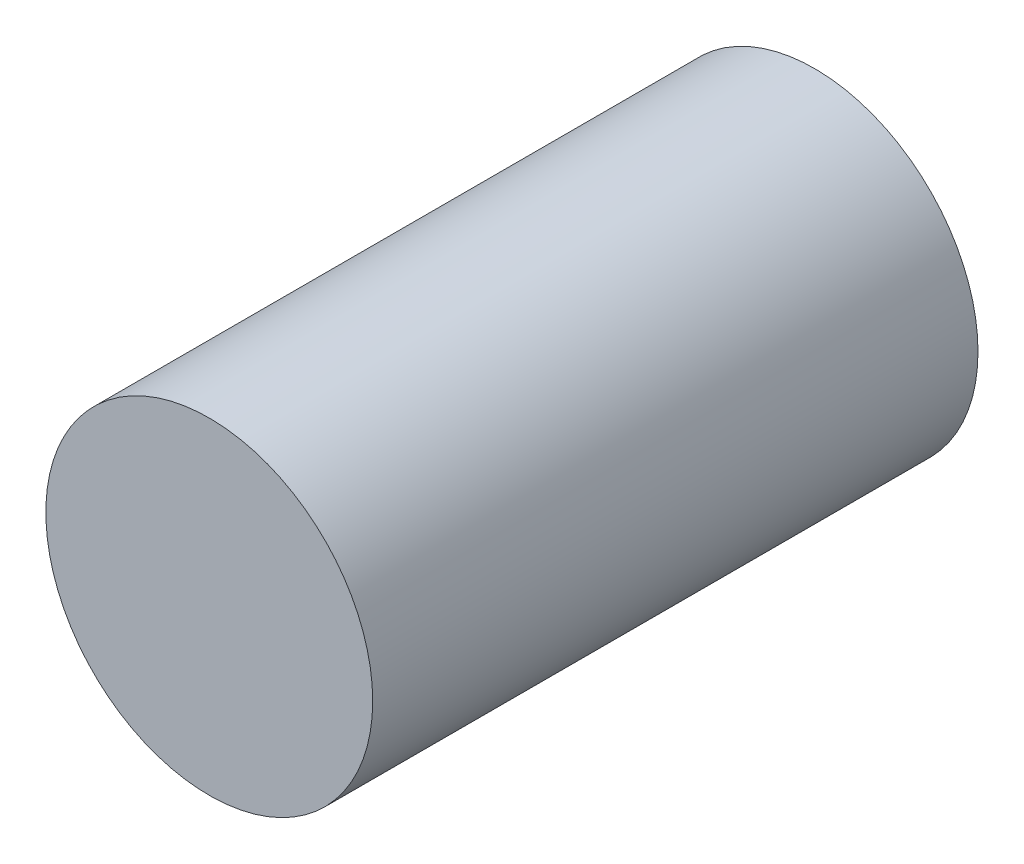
ISO-10303-21;
HEADER;
FILE_DESCRIPTION(('STEP AP214'),'2;1');
FILE_NAME('part.step','',(''),(''),'','','');
FILE_SCHEMA(('AUTOMOTIVE_DESIGN { 1 0 10303 214 1 1 1 1 }'));
ENDSEC;
DATA;
#1=APPLICATION_CONTEXT('core data for automotive mechanical design processes');
#2=APPLICATION_PROTOCOL_DEFINITION('international standard','automotive_design',2000,#1);
#3=PRODUCT_CONTEXT('',#1,'mechanical');
#4=PRODUCT('Part','Part','',(#3));
#5=PRODUCT_RELATED_PRODUCT_CATEGORY('part','',(#4));
#6=PRODUCT_DEFINITION_FORMATION('','',#4);
#7=PRODUCT_DEFINITION_CONTEXT('part definition',#1,'design');
#8=PRODUCT_DEFINITION('design','',#6,#7);
#9=PRODUCT_DEFINITION_SHAPE('','',#8);
#10=(LENGTH_UNIT() NAMED_UNIT(*) SI_UNIT(.MILLI.,.METRE.));
#11=(NAMED_UNIT(*) PLANE_ANGLE_UNIT() SI_UNIT($,.RADIAN.));
#12=(NAMED_UNIT(*) SI_UNIT($,.STERADIAN.) SOLID_ANGLE_UNIT());
#13=UNCERTAINTY_MEASURE_WITH_UNIT(LENGTH_MEASURE(1.E-05),#10,'distance_accuracy_value','');
#14=(GEOMETRIC_REPRESENTATION_CONTEXT(3) GLOBAL_UNCERTAINTY_ASSIGNED_CONTEXT((#13)) GLOBAL_UNIT_ASSIGNED_CONTEXT((#10,
#11,#12)) REPRESENTATION_CONTEXT('',''));
#15=CARTESIAN_POINT('',(0.,0.,0.));
#16=DIRECTION('',(0.,0.,1.));
#17=DIRECTION('',(1.,0.,0.));
#18=AXIS2_PLACEMENT_3D('',#15,#16,#17);
#19=CARTESIAN_POINT('',(0.,0.,50.));
#20=DIRECTION('',(0.,0.,-1.));
#21=DIRECTION('',(-1.,0.,0.));
#22=AXIS2_PLACEMENT_3D('',#19,#20,#21);
#23=CYLINDRICAL_SURFACE('',#22,13.5);
#24=CARTESIAN_POINT('',(0.,0.,50.));
#25=DIRECTION('',(0.,0.,1.));
#26=DIRECTION('',(1.,0.,0.));
#27=AXIS2_PLACEMENT_3D('',#24,#25,#26);
#28=CIRCLE('',#27,13.5);
#29=CARTESIAN_POINT('',(13.5,0.,50.));
#30=VERTEX_POINT('',#29);
#31=EDGE_CURVE('E10',#30,#30,#28,.T.);
#32=ORIENTED_EDGE('',*,*,#31,.F.);
#33=EDGE_LOOP('',(#32));
#34=FACE_BOUND('',#33,.T.);
#35=CARTESIAN_POINT('',(0.,0.,0.));
#36=DIRECTION('',(0.,0.,1.));
#37=DIRECTION('',(1.,0.,0.));
#38=AXIS2_PLACEMENT_3D('',#35,#36,#37);
#39=CIRCLE('',#38,13.5);
#40=CARTESIAN_POINT('',(13.5,0.,0.));
#41=VERTEX_POINT('',#40);
#42=EDGE_CURVE('E41',#41,#41,#39,.T.);
#43=ORIENTED_EDGE('',*,*,#42,.T.);
#44=EDGE_LOOP('',(#43));
#45=FACE_BOUND('',#44,.T.);
#46=ADVANCED_FACE('F38',(#34,#45),#23,.T.);
#47=CARTESIAN_POINT('',(0.,0.,50.));
#48=DIRECTION('',(0.,0.,1.));
#49=DIRECTION('',(1.,0.,0.));
#50=AXIS2_PLACEMENT_3D('',#47,#48,#49);
#51=PLANE('',#50);
#52=ORIENTED_EDGE('',*,*,#31,.T.);
#53=EDGE_LOOP('',(#52));
#54=FACE_BOUND('',#53,.T.);
#55=ADVANCED_FACE('F53',(#54),#51,.T.);
#56=CARTESIAN_POINT('',(0.,0.,0.));
#57=DIRECTION('',(0.,0.,1.));
#58=DIRECTION('',(1.,0.,0.));
#59=AXIS2_PLACEMENT_3D('',#56,#57,#58);
#60=PLANE('',#59);
#61=ORIENTED_EDGE('',*,*,#42,.F.);
#62=EDGE_LOOP('',(#61));
#63=FACE_BOUND('',#62,.T.);
#64=ADVANCED_FACE('F51',(#63),#60,.F.);
#65=CLOSED_SHELL('',(#46,#55,#64));
#66=MANIFOLD_SOLID_BREP('B2',#65);
#67=ADVANCED_BREP_SHAPE_REPRESENTATION('',(#18,#66),#14);
#68=SHAPE_DEFINITION_REPRESENTATION(#9,#67);
ENDSEC;
END-ISO-10303-21;
